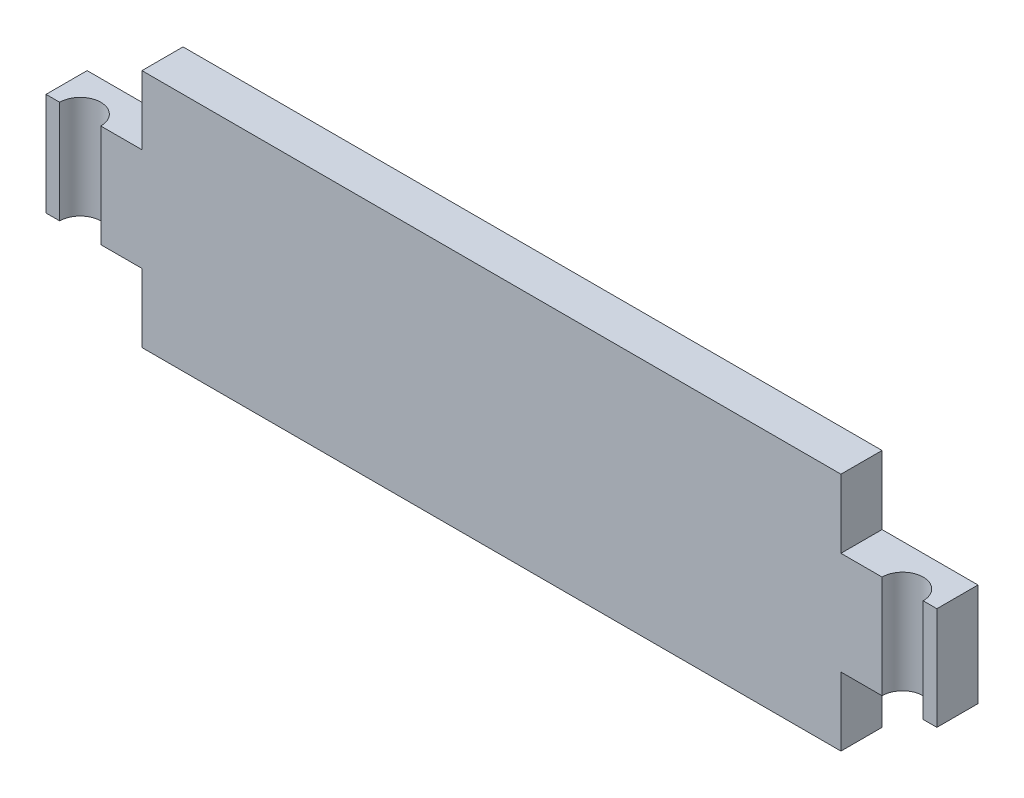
from build123d import *

# Parameters (mm, degrees)
EXTRUSION1_DEPTH        = 6
ESQUISSE2_R             = 3
ENL_V_MAT_EXTRU_1_DEPTH = 130.94614269


with BuildPart() as part:
    # Esquisse1 → Extrusion1 (new body)
    with BuildSketch(Plane.XY):
        Polygon((-5, 25), (-5, 10), (9, 10), (9, 0), (111, 0), (111, 10), (125, 10), (125, 25), (111, 25), (111, 35), (9, 35), (9, 25), align=None)
    extrude(amount=EXTRUSION1_DEPTH)

    # Esquisse2 → Enl_v. mat.-Extru.1 (cut, through all)
    with BuildSketch(Plane(origin=(0, 35, 0), x_dir=(-1, 0, 0), z_dir=(0, 1, 0))):
        with Locations((0, 6)):
            Circle(ESQUISSE2_R)
        with Locations((-120, 6)):
            Circle(ESQUISSE2_R)
    extrude(amount=-ENL_V_MAT_EXTRU_1_DEPTH, mode=Mode.SUBTRACT)


solid = part.part
